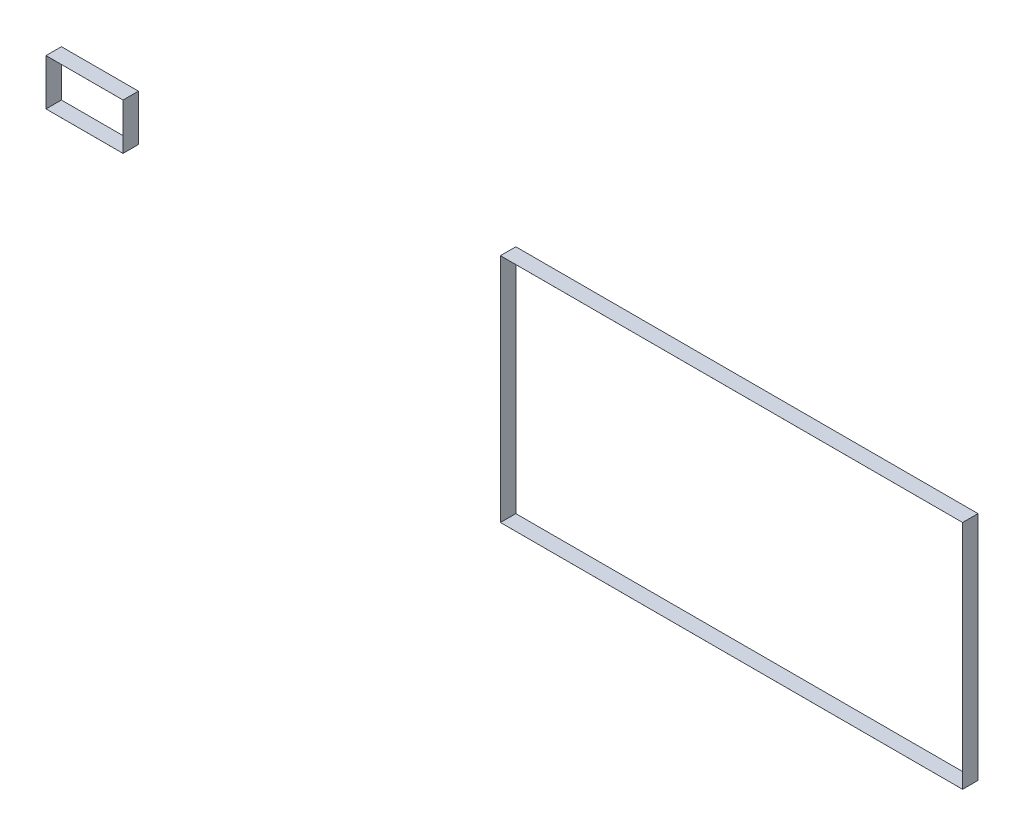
ISO-10303-21;
HEADER;
FILE_DESCRIPTION(('STEP AP214'),'2;1');
FILE_NAME('part.step','',(''),(''),'','','');
FILE_SCHEMA(('AUTOMOTIVE_DESIGN { 1 0 10303 214 1 1 1 1 }'));
ENDSEC;
DATA;
#1=APPLICATION_CONTEXT('core data for automotive mechanical design processes');
#2=APPLICATION_PROTOCOL_DEFINITION('international standard','automotive_design',2000,#1);
#3=PRODUCT_CONTEXT('',#1,'mechanical');
#4=PRODUCT('Part','Part','',(#3));
#5=PRODUCT_RELATED_PRODUCT_CATEGORY('part','',(#4));
#6=PRODUCT_DEFINITION_FORMATION('','',#4);
#7=PRODUCT_DEFINITION_CONTEXT('part definition',#1,'design');
#8=PRODUCT_DEFINITION('design','',#6,#7);
#9=PRODUCT_DEFINITION_SHAPE('','',#8);
#10=(LENGTH_UNIT() NAMED_UNIT(*) SI_UNIT(.MILLI.,.METRE.));
#11=(NAMED_UNIT(*) PLANE_ANGLE_UNIT() SI_UNIT($,.RADIAN.));
#12=(NAMED_UNIT(*) SI_UNIT($,.STERADIAN.) SOLID_ANGLE_UNIT());
#13=UNCERTAINTY_MEASURE_WITH_UNIT(LENGTH_MEASURE(1.E-05),#10,'distance_accuracy_value','');
#14=(GEOMETRIC_REPRESENTATION_CONTEXT(3) GLOBAL_UNCERTAINTY_ASSIGNED_CONTEXT((#13)) GLOBAL_UNIT_ASSIGNED_CONTEXT((#10,
#11,#12)) REPRESENTATION_CONTEXT('',''));
#15=CARTESIAN_POINT('',(0.,0.,0.));
#16=DIRECTION('',(0.,0.,1.));
#17=DIRECTION('',(1.,0.,0.));
#18=AXIS2_PLACEMENT_3D('',#15,#16,#17);
#19=CARTESIAN_POINT('',(0.,0.,1.));
#20=DIRECTION('',(0.,0.,1.));
#21=DIRECTION('',(1.,0.,0.));
#22=AXIS2_PLACEMENT_3D('',#19,#20,#21);
#23=PLANE('',#22);
#24=DIRECTION('',(0.,-1.,0.));
#25=VECTOR('',#24,1.);
#26=CARTESIAN_POINT('',(-29.501,11.5,1.));
#27=LINE('',#26,#25);
#28=CARTESIAN_POINT('',(-29.501,11.501,1.));
#29=VERTEX_POINT('',#28);
#30=CARTESIAN_POINT('',(-29.501,8.499,1.));
#31=VERTEX_POINT('',#30);
#32=EDGE_CURVE('E198',#29,#31,#27,.T.);
#33=ORIENTED_EDGE('',*,*,#32,.T.);
#34=DIRECTION('',(1.,0.,0.));
#35=VECTOR('',#34,1.);
#36=CARTESIAN_POINT('',(-29.5,8.499,1.));
#37=LINE('',#36,#35);
#38=CARTESIAN_POINT('',(-24.499,8.499,1.));
#39=VERTEX_POINT('',#38);
#40=EDGE_CURVE('E201',#31,#39,#37,.T.);
#41=ORIENTED_EDGE('',*,*,#40,.T.);
#42=DIRECTION('',(0.,1.,0.));
#43=VECTOR('',#42,1.);
#44=CARTESIAN_POINT('',(-24.499,11.5,1.));
#45=LINE('',#44,#43);
#46=CARTESIAN_POINT('',(-24.499,11.501,1.));
#47=VERTEX_POINT('',#46);
#48=EDGE_CURVE('E204',#39,#47,#45,.T.);
#49=ORIENTED_EDGE('',*,*,#48,.T.);
#50=DIRECTION('',(-1.,0.,0.));
#51=VECTOR('',#50,1.);
#52=CARTESIAN_POINT('',(-29.5,11.501,1.));
#53=LINE('',#52,#51);
#54=EDGE_CURVE('E206',#47,#29,#53,.T.);
#55=ORIENTED_EDGE('',*,*,#54,.T.);
#56=EDGE_LOOP('',(#33,#41,#49,#55));
#57=FACE_BOUND('',#56,.T.);
#58=DIRECTION('',(1.,0.,0.));
#59=VECTOR('',#58,1.);
#60=CARTESIAN_POINT('',(-29.5,8.5,1.));
#61=LINE('',#60,#59);
#62=CARTESIAN_POINT('',(-29.5,8.5,1.));
#63=VERTEX_POINT('',#62);
#64=CARTESIAN_POINT('',(-24.5,8.5,1.));
#65=VERTEX_POINT('',#64);
#66=EDGE_CURVE('E170',#63,#65,#61,.T.);
#67=ORIENTED_EDGE('',*,*,#66,.F.);
#68=DIRECTION('',(0.,-1.,0.));
#69=VECTOR('',#68,1.);
#70=CARTESIAN_POINT('',(-29.5,11.5,1.));
#71=LINE('',#70,#69);
#72=CARTESIAN_POINT('',(-29.5,11.5,1.));
#73=VERTEX_POINT('',#72);
#74=EDGE_CURVE('E162',#73,#63,#71,.T.);
#75=ORIENTED_EDGE('',*,*,#74,.F.);
#76=DIRECTION('',(-1.,0.,0.));
#77=VECTOR('',#76,1.);
#78=CARTESIAN_POINT('',(-29.5,11.5,1.));
#79=LINE('',#78,#77);
#80=CARTESIAN_POINT('',(-24.5,11.5,1.));
#81=VERTEX_POINT('',#80);
#82=EDGE_CURVE('E184',#81,#73,#79,.T.);
#83=ORIENTED_EDGE('',*,*,#82,.F.);
#84=DIRECTION('',(0.,1.,0.));
#85=VECTOR('',#84,1.);
#86=CARTESIAN_POINT('',(-24.5,11.5,1.));
#87=LINE('',#86,#85);
#88=EDGE_CURVE('E182',#65,#81,#87,.T.);
#89=ORIENTED_EDGE('',*,*,#88,.F.);
#90=EDGE_LOOP('',(#67,#75,#83,#89));
#91=FACE_BOUND('',#90,.T.);
#92=ADVANCED_FACE('F97',(#57,#91),#23,.T.);
#93=CARTESIAN_POINT('',(0.,0.,0.));
#94=DIRECTION('',(0.,0.,1.));
#95=DIRECTION('',(1.,0.,0.));
#96=AXIS2_PLACEMENT_3D('',#93,#94,#95);
#97=PLANE('',#96);
#98=DIRECTION('',(0.,-1.,0.));
#99=VECTOR('',#98,1.);
#100=CARTESIAN_POINT('',(-29.501,11.5,0.));
#101=LINE('',#100,#99);
#102=CARTESIAN_POINT('',(-29.501,11.501,0.));
#103=VERTEX_POINT('',#102);
#104=CARTESIAN_POINT('',(-29.501,8.499,0.));
#105=VERTEX_POINT('',#104);
#106=EDGE_CURVE('E178',#103,#105,#101,.T.);
#107=ORIENTED_EDGE('',*,*,#106,.F.);
#108=DIRECTION('',(-1.,0.,0.));
#109=VECTOR('',#108,1.);
#110=CARTESIAN_POINT('',(-29.5,11.501,0.));
#111=LINE('',#110,#109);
#112=CARTESIAN_POINT('',(-24.499,11.501,0.));
#113=VERTEX_POINT('',#112);
#114=EDGE_CURVE('E202',#113,#103,#111,.T.);
#115=ORIENTED_EDGE('',*,*,#114,.F.);
#116=DIRECTION('',(0.,1.,0.));
#117=VECTOR('',#116,1.);
#118=CARTESIAN_POINT('',(-24.499,11.5,0.));
#119=LINE('',#118,#117);
#120=CARTESIAN_POINT('',(-24.499,8.499,0.));
#121=VERTEX_POINT('',#120);
#122=EDGE_CURVE('E213',#121,#113,#119,.T.);
#123=ORIENTED_EDGE('',*,*,#122,.F.);
#124=DIRECTION('',(1.,0.,0.));
#125=VECTOR('',#124,1.);
#126=CARTESIAN_POINT('',(-29.5,8.499,0.));
#127=LINE('',#126,#125);
#128=EDGE_CURVE('E211',#105,#121,#127,.T.);
#129=ORIENTED_EDGE('',*,*,#128,.F.);
#130=EDGE_LOOP('',(#107,#115,#123,#129));
#131=FACE_BOUND('',#130,.T.);
#132=DIRECTION('',(0.,-1.,0.));
#133=VECTOR('',#132,1.);
#134=CARTESIAN_POINT('',(-29.5,11.5,0.));
#135=LINE('',#134,#133);
#136=CARTESIAN_POINT('',(-29.5,11.5,0.));
#137=VERTEX_POINT('',#136);
#138=CARTESIAN_POINT('',(-29.5,8.5,0.));
#139=VERTEX_POINT('',#138);
#140=EDGE_CURVE('E120',#137,#139,#135,.T.);
#141=ORIENTED_EDGE('',*,*,#140,.T.);
#142=DIRECTION('',(1.,0.,0.));
#143=VECTOR('',#142,1.);
#144=CARTESIAN_POINT('',(-29.5,8.5,0.));
#145=LINE('',#144,#143);
#146=CARTESIAN_POINT('',(-24.5,8.5,0.));
#147=VERTEX_POINT('',#146);
#148=EDGE_CURVE('E177',#139,#147,#145,.T.);
#149=ORIENTED_EDGE('',*,*,#148,.T.);
#150=DIRECTION('',(0.,1.,0.));
#151=VECTOR('',#150,1.);
#152=CARTESIAN_POINT('',(-24.5,11.5,0.));
#153=LINE('',#152,#151);
#154=CARTESIAN_POINT('',(-24.5,11.5,0.));
#155=VERTEX_POINT('',#154);
#156=EDGE_CURVE('E190',#147,#155,#153,.T.);
#157=ORIENTED_EDGE('',*,*,#156,.T.);
#158=DIRECTION('',(-1.,0.,0.));
#159=VECTOR('',#158,1.);
#160=CARTESIAN_POINT('',(-29.5,11.5,0.));
#161=LINE('',#160,#159);
#162=EDGE_CURVE('E171',#155,#137,#161,.T.);
#163=ORIENTED_EDGE('',*,*,#162,.T.);
#164=EDGE_LOOP('',(#141,#149,#157,#163));
#165=FACE_BOUND('',#164,.T.);
#166=ADVANCED_FACE('F231',(#131,#165),#97,.F.);
#167=CARTESIAN_POINT('',(-29.501,11.5,1.));
#168=DIRECTION('',(1.,0.,0.));
#169=DIRECTION('',(0.,0.,-1.));
#170=AXIS2_PLACEMENT_3D('',#167,#168,#169);
#171=PLANE('',#170);
#172=ORIENTED_EDGE('',*,*,#106,.T.);
#173=DIRECTION('',(0.,0.,-1.));
#174=VECTOR('',#173,1.);
#175=CARTESIAN_POINT('',(-29.501,8.499,1.));
#176=LINE('',#175,#174);
#177=EDGE_CURVE('E13',#31,#105,#176,.T.);
#178=ORIENTED_EDGE('',*,*,#177,.F.);
#179=ORIENTED_EDGE('',*,*,#32,.F.);
#180=DIRECTION('',(0.,0.,-1.));
#181=VECTOR('',#180,1.);
#182=CARTESIAN_POINT('',(-29.501,11.501,1.));
#183=LINE('',#182,#181);
#184=EDGE_CURVE('E208',#29,#103,#183,.T.);
#185=ORIENTED_EDGE('',*,*,#184,.T.);
#186=EDGE_LOOP('',(#172,#178,#179,#185));
#187=FACE_BOUND('',#186,.T.);
#188=ADVANCED_FACE('F99',(#187),#171,.F.);
#189=CARTESIAN_POINT('',(-29.5,8.499,1.));
#190=DIRECTION('',(0.,1.,0.));
#191=DIRECTION('',(0.,0.,1.));
#192=AXIS2_PLACEMENT_3D('',#189,#190,#191);
#193=PLANE('',#192);
#194=ORIENTED_EDGE('',*,*,#128,.T.);
#195=DIRECTION('',(0.,0.,-1.));
#196=VECTOR('',#195,1.);
#197=CARTESIAN_POINT('',(-24.499,8.499,1.));
#198=LINE('',#197,#196);
#199=EDGE_CURVE('E105',#39,#121,#198,.T.);
#200=ORIENTED_EDGE('',*,*,#199,.F.);
#201=ORIENTED_EDGE('',*,*,#40,.F.);
#202=ORIENTED_EDGE('',*,*,#177,.T.);
#203=EDGE_LOOP('',(#194,#200,#201,#202));
#204=FACE_BOUND('',#203,.T.);
#205=ADVANCED_FACE('F241',(#204),#193,.F.);
#206=CARTESIAN_POINT('',(-24.499,11.5,1.));
#207=DIRECTION('',(-1.,0.,0.));
#208=DIRECTION('',(0.,0.,1.));
#209=AXIS2_PLACEMENT_3D('',#206,#207,#208);
#210=PLANE('',#209);
#211=ORIENTED_EDGE('',*,*,#122,.T.);
#212=DIRECTION('',(0.,0.,-1.));
#213=VECTOR('',#212,1.);
#214=CARTESIAN_POINT('',(-24.499,11.501,1.));
#215=LINE('',#214,#213);
#216=EDGE_CURVE('E218',#47,#113,#215,.T.);
#217=ORIENTED_EDGE('',*,*,#216,.F.);
#218=ORIENTED_EDGE('',*,*,#48,.F.);
#219=ORIENTED_EDGE('',*,*,#199,.T.);
#220=EDGE_LOOP('',(#211,#217,#218,#219));
#221=FACE_BOUND('',#220,.T.);
#222=ADVANCED_FACE('F225',(#221),#210,.F.);
#223=CARTESIAN_POINT('',(-29.5,11.501,1.));
#224=DIRECTION('',(0.,-1.,0.));
#225=DIRECTION('',(0.,0.,-1.));
#226=AXIS2_PLACEMENT_3D('',#223,#224,#225);
#227=PLANE('',#226);
#228=ORIENTED_EDGE('',*,*,#114,.T.);
#229=ORIENTED_EDGE('',*,*,#184,.F.);
#230=ORIENTED_EDGE('',*,*,#54,.F.);
#231=ORIENTED_EDGE('',*,*,#216,.T.);
#232=EDGE_LOOP('',(#228,#229,#230,#231));
#233=FACE_BOUND('',#232,.T.);
#234=ADVANCED_FACE('F235',(#233),#227,.F.);
#235=CARTESIAN_POINT('',(-29.5,11.5,1.));
#236=DIRECTION('',(1.,0.,0.));
#237=DIRECTION('',(0.,0.,-1.));
#238=AXIS2_PLACEMENT_3D('',#235,#236,#237);
#239=PLANE('',#238);
#240=ORIENTED_EDGE('',*,*,#140,.F.);
#241=DIRECTION('',(0.,0.,-1.));
#242=VECTOR('',#241,1.);
#243=CARTESIAN_POINT('',(-29.5,11.5,1.));
#244=LINE('',#243,#242);
#245=EDGE_CURVE('E166',#73,#137,#244,.T.);
#246=ORIENTED_EDGE('',*,*,#245,.F.);
#247=ORIENTED_EDGE('',*,*,#74,.T.);
#248=DIRECTION('',(0.,0.,-1.));
#249=VECTOR('',#248,1.);
#250=CARTESIAN_POINT('',(-29.5,8.5,1.));
#251=LINE('',#250,#249);
#252=EDGE_CURVE('E165',#63,#139,#251,.T.);
#253=ORIENTED_EDGE('',*,*,#252,.T.);
#254=EDGE_LOOP('',(#240,#246,#247,#253));
#255=FACE_BOUND('',#254,.T.);
#256=ADVANCED_FACE('F164',(#255),#239,.T.);
#257=CARTESIAN_POINT('',(-29.5,8.5,1.));
#258=DIRECTION('',(0.,1.,0.));
#259=DIRECTION('',(0.,0.,1.));
#260=AXIS2_PLACEMENT_3D('',#257,#258,#259);
#261=PLANE('',#260);
#262=ORIENTED_EDGE('',*,*,#148,.F.);
#263=ORIENTED_EDGE('',*,*,#252,.F.);
#264=ORIENTED_EDGE('',*,*,#66,.T.);
#265=DIRECTION('',(0.,0.,-1.));
#266=VECTOR('',#265,1.);
#267=CARTESIAN_POINT('',(-24.5,8.5,1.));
#268=LINE('',#267,#266);
#269=EDGE_CURVE('E179',#65,#147,#268,.T.);
#270=ORIENTED_EDGE('',*,*,#269,.T.);
#271=EDGE_LOOP('',(#262,#263,#264,#270));
#272=FACE_BOUND('',#271,.T.);
#273=ADVANCED_FACE('F174',(#272),#261,.T.);
#274=CARTESIAN_POINT('',(-24.5,11.5,1.));
#275=DIRECTION('',(-1.,0.,0.));
#276=DIRECTION('',(0.,0.,1.));
#277=AXIS2_PLACEMENT_3D('',#274,#275,#276);
#278=PLANE('',#277);
#279=ORIENTED_EDGE('',*,*,#156,.F.);
#280=ORIENTED_EDGE('',*,*,#269,.F.);
#281=ORIENTED_EDGE('',*,*,#88,.T.);
#282=DIRECTION('',(0.,0.,-1.));
#283=VECTOR('',#282,1.);
#284=CARTESIAN_POINT('',(-24.5,11.5,1.));
#285=LINE('',#284,#283);
#286=EDGE_CURVE('E112',#81,#155,#285,.T.);
#287=ORIENTED_EDGE('',*,*,#286,.T.);
#288=EDGE_LOOP('',(#279,#280,#281,#287));
#289=FACE_BOUND('',#288,.T.);
#290=ADVANCED_FACE('F264',(#289),#278,.T.);
#291=CARTESIAN_POINT('',(-29.5,11.5,1.));
#292=DIRECTION('',(0.,-1.,0.));
#293=DIRECTION('',(0.,0.,-1.));
#294=AXIS2_PLACEMENT_3D('',#291,#292,#293);
#295=PLANE('',#294);
#296=ORIENTED_EDGE('',*,*,#162,.F.);
#297=ORIENTED_EDGE('',*,*,#286,.F.);
#298=ORIENTED_EDGE('',*,*,#82,.T.);
#299=ORIENTED_EDGE('',*,*,#245,.T.);
#300=EDGE_LOOP('',(#296,#297,#298,#299));
#301=FACE_BOUND('',#300,.T.);
#302=ADVANCED_FACE('F268',(#301),#295,.T.);
#303=CLOSED_SHELL('',(#92,#166,#188,#205,#222,#234,#256,#273,#290,#302));
#304=MANIFOLD_SOLID_BREP('B2',#303);
#305=CARTESIAN_POINT('',(0.,0.,1.));
#306=DIRECTION('',(0.,0.,1.));
#307=DIRECTION('',(1.,0.,0.));
#308=AXIS2_PLACEMENT_3D('',#305,#306,#307);
#309=PLANE('',#308);
#310=DIRECTION('',(0.,-1.,0.));
#311=VECTOR('',#310,1.);
#312=CARTESIAN_POINT('',(-0.001,0.,1.));
#313=LINE('',#312,#311);
#314=CARTESIAN_POINT('',(-0.001,15.001,1.));
#315=VERTEX_POINT('',#314);
#316=CARTESIAN_POINT('',(-0.001,-0.001,1.));
#317=VERTEX_POINT('',#316);
#318=EDGE_CURVE('E468',#315,#317,#313,.T.);
#319=ORIENTED_EDGE('',*,*,#318,.T.);
#320=DIRECTION('',(1.,0.,0.));
#321=VECTOR('',#320,1.);
#322=CARTESIAN_POINT('',(0.,-0.001,1.));
#323=LINE('',#322,#321);
#324=CARTESIAN_POINT('',(30.001,-0.001,1.));
#325=VERTEX_POINT('',#324);
#326=EDGE_CURVE('E471',#317,#325,#323,.T.);
#327=ORIENTED_EDGE('',*,*,#326,.T.);
#328=DIRECTION('',(0.,1.,0.));
#329=VECTOR('',#328,1.);
#330=CARTESIAN_POINT('',(30.001,0.,1.));
#331=LINE('',#330,#329);
#332=CARTESIAN_POINT('',(30.001,15.001,1.));
#333=VERTEX_POINT('',#332);
#334=EDGE_CURVE('E474',#325,#333,#331,.T.);
#335=ORIENTED_EDGE('',*,*,#334,.T.);
#336=DIRECTION('',(-1.,0.,0.));
#337=VECTOR('',#336,1.);
#338=CARTESIAN_POINT('',(0.,15.001,1.));
#339=LINE('',#338,#337);
#340=EDGE_CURVE('E476',#333,#315,#339,.T.);
#341=ORIENTED_EDGE('',*,*,#340,.T.);
#342=EDGE_LOOP('',(#319,#327,#335,#341));
#343=FACE_BOUND('',#342,.T.);
#344=DIRECTION('',(1.,0.,0.));
#345=VECTOR('',#344,1.);
#346=CARTESIAN_POINT('',(0.,0.,1.));
#347=LINE('',#346,#345);
#348=CARTESIAN_POINT('',(0.,0.,1.));
#349=VERTEX_POINT('',#348);
#350=CARTESIAN_POINT('',(30.,0.,1.));
#351=VERTEX_POINT('',#350);
#352=EDGE_CURVE('E440',#349,#351,#347,.T.);
#353=ORIENTED_EDGE('',*,*,#352,.F.);
#354=DIRECTION('',(0.,-1.,0.));
#355=VECTOR('',#354,1.);
#356=CARTESIAN_POINT('',(0.,0.,1.));
#357=LINE('',#356,#355);
#358=CARTESIAN_POINT('',(0.,15.,1.));
#359=VERTEX_POINT('',#358);
#360=EDGE_CURVE('E432',#359,#349,#357,.T.);
#361=ORIENTED_EDGE('',*,*,#360,.F.);
#362=DIRECTION('',(-1.,0.,0.));
#363=VECTOR('',#362,1.);
#364=CARTESIAN_POINT('',(0.,15.,1.));
#365=LINE('',#364,#363);
#366=CARTESIAN_POINT('',(30.,15.,1.));
#367=VERTEX_POINT('',#366);
#368=EDGE_CURVE('E454',#367,#359,#365,.T.);
#369=ORIENTED_EDGE('',*,*,#368,.F.);
#370=DIRECTION('',(0.,1.,0.));
#371=VECTOR('',#370,1.);
#372=CARTESIAN_POINT('',(30.,0.,1.));
#373=LINE('',#372,#371);
#374=EDGE_CURVE('E452',#351,#367,#373,.T.);
#375=ORIENTED_EDGE('',*,*,#374,.F.);
#376=EDGE_LOOP('',(#353,#361,#369,#375));
#377=FACE_BOUND('',#376,.T.);
#378=ADVANCED_FACE('F367',(#343,#377),#309,.T.);
#379=CARTESIAN_POINT('',(0.,0.,0.));
#380=DIRECTION('',(0.,0.,1.));
#381=DIRECTION('',(1.,0.,0.));
#382=AXIS2_PLACEMENT_3D('',#379,#380,#381);
#383=PLANE('',#382);
#384=DIRECTION('',(0.,-1.,0.));
#385=VECTOR('',#384,1.);
#386=CARTESIAN_POINT('',(-0.001,0.,0.));
#387=LINE('',#386,#385);
#388=CARTESIAN_POINT('',(-0.001,15.001,0.));
#389=VERTEX_POINT('',#388);
#390=CARTESIAN_POINT('',(-0.001,-0.001,0.));
#391=VERTEX_POINT('',#390);
#392=EDGE_CURVE('E448',#389,#391,#387,.T.);
#393=ORIENTED_EDGE('',*,*,#392,.F.);
#394=DIRECTION('',(-1.,0.,0.));
#395=VECTOR('',#394,1.);
#396=CARTESIAN_POINT('',(0.,15.001,0.));
#397=LINE('',#396,#395);
#398=CARTESIAN_POINT('',(30.001,15.001,0.));
#399=VERTEX_POINT('',#398);
#400=EDGE_CURVE('E472',#399,#389,#397,.T.);
#401=ORIENTED_EDGE('',*,*,#400,.F.);
#402=DIRECTION('',(0.,1.,0.));
#403=VECTOR('',#402,1.);
#404=CARTESIAN_POINT('',(30.001,0.,0.));
#405=LINE('',#404,#403);
#406=CARTESIAN_POINT('',(30.001,-0.001,0.));
#407=VERTEX_POINT('',#406);
#408=EDGE_CURVE('E483',#407,#399,#405,.T.);
#409=ORIENTED_EDGE('',*,*,#408,.F.);
#410=DIRECTION('',(1.,0.,0.));
#411=VECTOR('',#410,1.);
#412=CARTESIAN_POINT('',(0.,-0.001,0.));
#413=LINE('',#412,#411);
#414=EDGE_CURVE('E481',#391,#407,#413,.T.);
#415=ORIENTED_EDGE('',*,*,#414,.F.);
#416=EDGE_LOOP('',(#393,#401,#409,#415));
#417=FACE_BOUND('',#416,.T.);
#418=DIRECTION('',(0.,-1.,0.));
#419=VECTOR('',#418,1.);
#420=CARTESIAN_POINT('',(0.,0.,0.));
#421=LINE('',#420,#419);
#422=CARTESIAN_POINT('',(0.,15.,0.));
#423=VERTEX_POINT('',#422);
#424=CARTESIAN_POINT('',(0.,0.,0.));
#425=VERTEX_POINT('',#424);
#426=EDGE_CURVE('E390',#423,#425,#421,.T.);
#427=ORIENTED_EDGE('',*,*,#426,.T.);
#428=DIRECTION('',(1.,0.,0.));
#429=VECTOR('',#428,1.);
#430=CARTESIAN_POINT('',(0.,0.,0.));
#431=LINE('',#430,#429);
#432=CARTESIAN_POINT('',(30.,0.,0.));
#433=VERTEX_POINT('',#432);
#434=EDGE_CURVE('E447',#425,#433,#431,.T.);
#435=ORIENTED_EDGE('',*,*,#434,.T.);
#436=DIRECTION('',(0.,1.,0.));
#437=VECTOR('',#436,1.);
#438=CARTESIAN_POINT('',(30.,0.,0.));
#439=LINE('',#438,#437);
#440=CARTESIAN_POINT('',(30.,15.,0.));
#441=VERTEX_POINT('',#440);
#442=EDGE_CURVE('E460',#433,#441,#439,.T.);
#443=ORIENTED_EDGE('',*,*,#442,.T.);
#444=DIRECTION('',(-1.,0.,0.));
#445=VECTOR('',#444,1.);
#446=CARTESIAN_POINT('',(0.,15.,0.));
#447=LINE('',#446,#445);
#448=EDGE_CURVE('E441',#441,#423,#447,.T.);
#449=ORIENTED_EDGE('',*,*,#448,.T.);
#450=EDGE_LOOP('',(#427,#435,#443,#449));
#451=FACE_BOUND('',#450,.T.);
#452=ADVANCED_FACE('F501',(#417,#451),#383,.F.);
#453=CARTESIAN_POINT('',(-0.001,0.,1.));
#454=DIRECTION('',(1.,0.,0.));
#455=DIRECTION('',(0.,0.,-1.));
#456=AXIS2_PLACEMENT_3D('',#453,#454,#455);
#457=PLANE('',#456);
#458=ORIENTED_EDGE('',*,*,#392,.T.);
#459=DIRECTION('',(0.,0.,-1.));
#460=VECTOR('',#459,1.);
#461=CARTESIAN_POINT('',(-0.001,-0.001,1.));
#462=LINE('',#461,#460);
#463=EDGE_CURVE('E95',#317,#391,#462,.T.);
#464=ORIENTED_EDGE('',*,*,#463,.F.);
#465=ORIENTED_EDGE('',*,*,#318,.F.);
#466=DIRECTION('',(0.,0.,-1.));
#467=VECTOR('',#466,1.);
#468=CARTESIAN_POINT('',(-0.001,15.001,1.));
#469=LINE('',#468,#467);
#470=EDGE_CURVE('E478',#315,#389,#469,.T.);
#471=ORIENTED_EDGE('',*,*,#470,.T.);
#472=EDGE_LOOP('',(#458,#464,#465,#471));
#473=FACE_BOUND('',#472,.T.);
#474=ADVANCED_FACE('F369',(#473),#457,.F.);
#475=CARTESIAN_POINT('',(0.,-0.001,1.));
#476=DIRECTION('',(0.,1.,0.));
#477=DIRECTION('',(0.,0.,1.));
#478=AXIS2_PLACEMENT_3D('',#475,#476,#477);
#479=PLANE('',#478);
#480=ORIENTED_EDGE('',*,*,#414,.T.);
#481=DIRECTION('',(0.,0.,-1.));
#482=VECTOR('',#481,1.);
#483=CARTESIAN_POINT('',(30.001,-0.001,1.));
#484=LINE('',#483,#482);
#485=EDGE_CURVE('E375',#325,#407,#484,.T.);
#486=ORIENTED_EDGE('',*,*,#485,.F.);
#487=ORIENTED_EDGE('',*,*,#326,.F.);
#488=ORIENTED_EDGE('',*,*,#463,.T.);
#489=EDGE_LOOP('',(#480,#486,#487,#488));
#490=FACE_BOUND('',#489,.T.);
#491=ADVANCED_FACE('F511',(#490),#479,.F.);
#492=CARTESIAN_POINT('',(30.001,0.,1.));
#493=DIRECTION('',(-1.,0.,0.));
#494=DIRECTION('',(0.,0.,1.));
#495=AXIS2_PLACEMENT_3D('',#492,#493,#494);
#496=PLANE('',#495);
#497=ORIENTED_EDGE('',*,*,#408,.T.);
#498=DIRECTION('',(0.,0.,-1.));
#499=VECTOR('',#498,1.);
#500=CARTESIAN_POINT('',(30.001,15.001,1.));
#501=LINE('',#500,#499);
#502=EDGE_CURVE('E488',#333,#399,#501,.T.);
#503=ORIENTED_EDGE('',*,*,#502,.F.);
#504=ORIENTED_EDGE('',*,*,#334,.F.);
#505=ORIENTED_EDGE('',*,*,#485,.T.);
#506=EDGE_LOOP('',(#497,#503,#504,#505));
#507=FACE_BOUND('',#506,.T.);
#508=ADVANCED_FACE('F495',(#507),#496,.F.);
#509=CARTESIAN_POINT('',(0.,15.001,1.));
#510=DIRECTION('',(0.,-1.,0.));
#511=DIRECTION('',(0.,0.,-1.));
#512=AXIS2_PLACEMENT_3D('',#509,#510,#511);
#513=PLANE('',#512);
#514=ORIENTED_EDGE('',*,*,#400,.T.);
#515=ORIENTED_EDGE('',*,*,#470,.F.);
#516=ORIENTED_EDGE('',*,*,#340,.F.);
#517=ORIENTED_EDGE('',*,*,#502,.T.);
#518=EDGE_LOOP('',(#514,#515,#516,#517));
#519=FACE_BOUND('',#518,.T.);
#520=ADVANCED_FACE('F505',(#519),#513,.F.);
#521=CARTESIAN_POINT('',(0.,0.,1.));
#522=DIRECTION('',(1.,0.,0.));
#523=DIRECTION('',(0.,0.,-1.));
#524=AXIS2_PLACEMENT_3D('',#521,#522,#523);
#525=PLANE('',#524);
#526=ORIENTED_EDGE('',*,*,#426,.F.);
#527=DIRECTION('',(0.,0.,-1.));
#528=VECTOR('',#527,1.);
#529=CARTESIAN_POINT('',(0.,15.,1.));
#530=LINE('',#529,#528);
#531=EDGE_CURVE('E436',#359,#423,#530,.T.);
#532=ORIENTED_EDGE('',*,*,#531,.F.);
#533=ORIENTED_EDGE('',*,*,#360,.T.);
#534=DIRECTION('',(0.,0.,-1.));
#535=VECTOR('',#534,1.);
#536=CARTESIAN_POINT('',(0.,0.,1.));
#537=LINE('',#536,#535);
#538=EDGE_CURVE('E435',#349,#425,#537,.T.);
#539=ORIENTED_EDGE('',*,*,#538,.T.);
#540=EDGE_LOOP('',(#526,#532,#533,#539));
#541=FACE_BOUND('',#540,.T.);
#542=ADVANCED_FACE('F434',(#541),#525,.T.);
#543=CARTESIAN_POINT('',(0.,0.,1.));
#544=DIRECTION('',(0.,1.,0.));
#545=DIRECTION('',(0.,0.,1.));
#546=AXIS2_PLACEMENT_3D('',#543,#544,#545);
#547=PLANE('',#546);
#548=ORIENTED_EDGE('',*,*,#434,.F.);
#549=ORIENTED_EDGE('',*,*,#538,.F.);
#550=ORIENTED_EDGE('',*,*,#352,.T.);
#551=DIRECTION('',(0.,0.,-1.));
#552=VECTOR('',#551,1.);
#553=CARTESIAN_POINT('',(30.,0.,1.));
#554=LINE('',#553,#552);
#555=EDGE_CURVE('E449',#351,#433,#554,.T.);
#556=ORIENTED_EDGE('',*,*,#555,.T.);
#557=EDGE_LOOP('',(#548,#549,#550,#556));
#558=FACE_BOUND('',#557,.T.);
#559=ADVANCED_FACE('F444',(#558),#547,.T.);
#560=CARTESIAN_POINT('',(30.,0.,1.));
#561=DIRECTION('',(-1.,0.,0.));
#562=DIRECTION('',(0.,0.,1.));
#563=AXIS2_PLACEMENT_3D('',#560,#561,#562);
#564=PLANE('',#563);
#565=ORIENTED_EDGE('',*,*,#442,.F.);
#566=ORIENTED_EDGE('',*,*,#555,.F.);
#567=ORIENTED_EDGE('',*,*,#374,.T.);
#568=DIRECTION('',(0.,0.,-1.));
#569=VECTOR('',#568,1.);
#570=CARTESIAN_POINT('',(30.,15.,1.));
#571=LINE('',#570,#569);
#572=EDGE_CURVE('E382',#367,#441,#571,.T.);
#573=ORIENTED_EDGE('',*,*,#572,.T.);
#574=EDGE_LOOP('',(#565,#566,#567,#573));
#575=FACE_BOUND('',#574,.T.);
#576=ADVANCED_FACE('F534',(#575),#564,.T.);
#577=CARTESIAN_POINT('',(0.,15.,1.));
#578=DIRECTION('',(0.,-1.,0.));
#579=DIRECTION('',(0.,0.,-1.));
#580=AXIS2_PLACEMENT_3D('',#577,#578,#579);
#581=PLANE('',#580);
#582=ORIENTED_EDGE('',*,*,#448,.F.);
#583=ORIENTED_EDGE('',*,*,#572,.F.);
#584=ORIENTED_EDGE('',*,*,#368,.T.);
#585=ORIENTED_EDGE('',*,*,#531,.T.);
#586=EDGE_LOOP('',(#582,#583,#584,#585));
#587=FACE_BOUND('',#586,.T.);
#588=ADVANCED_FACE('F538',(#587),#581,.T.);
#589=CLOSED_SHELL('',(#378,#452,#474,#491,#508,#520,#542,#559,#576,#588));
#590=MANIFOLD_SOLID_BREP('B7',#589);
#591=ADVANCED_BREP_SHAPE_REPRESENTATION('',(#18,#304,#590),#14);
#592=SHAPE_DEFINITION_REPRESENTATION(#9,#591);
ENDSEC;
END-ISO-10303-21;
